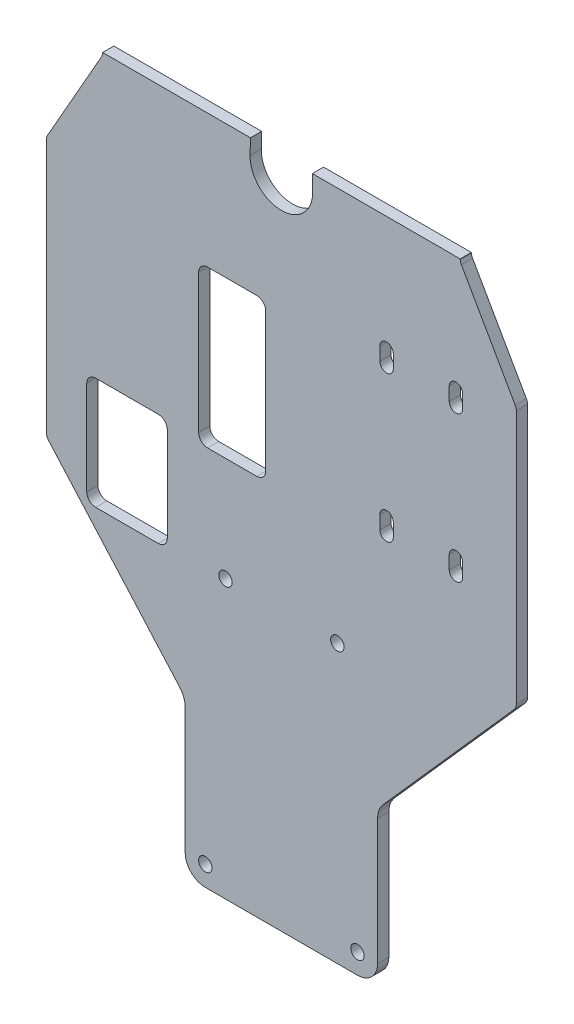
from build123d import *

# Parameters (mm, degrees)
ESQUISSE1_R          = 1.5
BASE_EXTRUSION_DEPTH = 2.5


with BuildPart() as part:
    # Esquisse1 → Base-Extrusion (new body)
    with BuildSketch(Plane(origin=(0, 0, -2.5), x_dir=(-1, 0, 0), z_dir=(0, 0, -1))):
        with BuildLine():
            Line((6.919803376, -122.192704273), (6.998191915, -125.640909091))
            ThreePointArc((6.998191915, -125.640909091), (0, -132.8), (-6.998191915, -125.640909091))
            Line((-6.998191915, -125.640909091), (-6.919803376, -122.192704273))
            Line((-6.919803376, -122.192704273), (-39.947881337, -122.192704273))
            Line((-39.947881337, -122.192704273), (-39.96255784, -122.363717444))
            ThreePointArc((-39.96255784, -122.363717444), (-40.04524289, -122.78594755), (-40.216319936, -123.180723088))
            Line((-40.216319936, -123.180723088), (-52.238913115, -144.340487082))
            ThreePointArc((-52.238913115, -144.340487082), (-52.433626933, -144.817539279), (-52.5, -145.328505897))
            Line((-52.5, -145.328505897), (-52.5, -202.041633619))
            ThreePointArc((-52.5, -202.041633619), (-52.370073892, -202.750734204), (-51.99717636, -203.367704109))
            Line((-51.99717636, -203.367704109), (-22.757059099, -236.380739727))
            ThreePointArc((-22.757059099, -236.380739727), (-21.824815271, -237.923164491), (-21.5, -239.695915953))
            Line((-21.5, -239.695915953), (-21.5, -267.8))
            ThreePointArc((-21.5, -267.8), (-20.181980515, -270.981980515), (-17, -272.3))
            Line((-17, -272.3), (17, -272.3))
            ThreePointArc((17, -272.3), (20.181980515, -270.981980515), (21.5, -267.8))
            Line((21.5, -267.8), (21.5, -239.695915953))
            ThreePointArc((21.5, -239.695915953), (21.824815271, -237.923164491), (22.757059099, -236.380739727))
            Line((22.757059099, -236.380739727), (51.99717636, -203.367704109))
            ThreePointArc((51.99717636, -203.367704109), (52.370073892, -202.750734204), (52.5, -202.041633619))
            Line((52.5, -202.041633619), (52.5, -145.328505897))
            ThreePointArc((52.5, -145.328505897), (52.433626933, -144.817539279), (52.238913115, -144.340487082))
            Line((52.238913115, -144.340487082), (40.216319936, -123.180723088))
            ThreePointArc((40.216319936, -123.180723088), (40.04524289, -122.78594755), (39.96255784, -122.363717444))
            Line((39.96255784, -122.363717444), (39.947881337, -122.192704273))
            Line((39.947881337, -122.192704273), (6.919803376, -122.192704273))
        make_face()
        with Locations(Location((-12.5, -210.3, 0), (0, 0, 180))):
            Circle(ESQUISSE1_R, mode=Mode.SUBTRACT)
        with Locations(Location((12.5, -210.3, 0), (0, 0, 180))):
            Circle(ESQUISSE1_R, mode=Mode.SUBTRACT)
        with Locations(Location((-17, -267.8, 0), (0, 0, 180))):
            Circle(ESQUISSE1_R, mode=Mode.SUBTRACT)
        with Locations(Location((17, -267.8, 0), (0, 0, 180))):
            Circle(ESQUISSE1_R, mode=Mode.SUBTRACT)
        with BuildLine():
            Line((5.5, -152), (16.5, -152))
            ThreePointArc((16.5, -152), (17.914213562, -152.585786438), (18.5, -154))
            Line((18.5, -154), (18.5, -185))
            ThreePointArc((18.5, -185), (17.914213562, -186.414213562), (16.5, -187))
            Line((16.5, -187), (5.5, -187))
            ThreePointArc((5.5, -187), (4.085786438, -186.414213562), (3.5, -185))
            Line((3.5, -185), (3.5, -154))
            ThreePointArc((3.5, -154), (4.085786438, -152.585786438), (5.5, -152))
        make_face(mode=Mode.SUBTRACT)
        with BuildLine():
            Line((27.5, -186), (41.5, -186))
            ThreePointArc((41.5, -186), (42.914213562, -186.585786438), (43.5, -188))
            Line((43.5, -188), (43.5, -209))
            ThreePointArc((43.5, -209), (42.914213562, -210.414213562), (41.5, -211))
            Line((41.5, -211), (27.5, -211))
            ThreePointArc((27.5, -211), (26.085786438, -210.414213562), (25.5, -209))
            Line((25.5, -209), (25.5, -188))
            ThreePointArc((25.5, -188), (26.085786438, -186.585786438), (27.5, -186))
        make_face(mode=Mode.SUBTRACT)
        with BuildLine():
            Line((-37.5, -180.6), (-37.5, -183.6))
            ThreePointArc((-37.5, -183.6), (-39, -185.1), (-40.5, -183.6))
            Line((-40.5, -183.6), (-40.5, -180.6))
            ThreePointArc((-40.5, -180.6), (-39, -179.1), (-37.5, -180.6))
        make_face(mode=Mode.SUBTRACT)
        with BuildLine():
            Line((-22, -180.6), (-22, -183.6))
            ThreePointArc((-22, -183.6), (-23.5, -185.1), (-25, -183.6))
            Line((-25, -183.6), (-25, -180.6))
            ThreePointArc((-25, -180.6), (-23.5, -179.1), (-22, -180.6))
        make_face(mode=Mode.SUBTRACT)
        with BuildLine():
            Line((-37.5, -148), (-37.5, -151))
            ThreePointArc((-37.5, -151), (-39, -152.5), (-40.5, -151))
            Line((-40.5, -151), (-40.5, -148))
            ThreePointArc((-40.5, -148), (-39, -146.5), (-37.5, -148))
        make_face(mode=Mode.SUBTRACT)
        with BuildLine():
            Line((-22, -148), (-22, -151))
            ThreePointArc((-22, -151), (-23.5, -152.5), (-25, -151))
            Line((-25, -151), (-25, -148))
            ThreePointArc((-25, -148), (-23.5, -146.5), (-22, -148))
        make_face(mode=Mode.SUBTRACT)
    extrude(amount=-BASE_EXTRUSION_DEPTH)


solid = part.part
